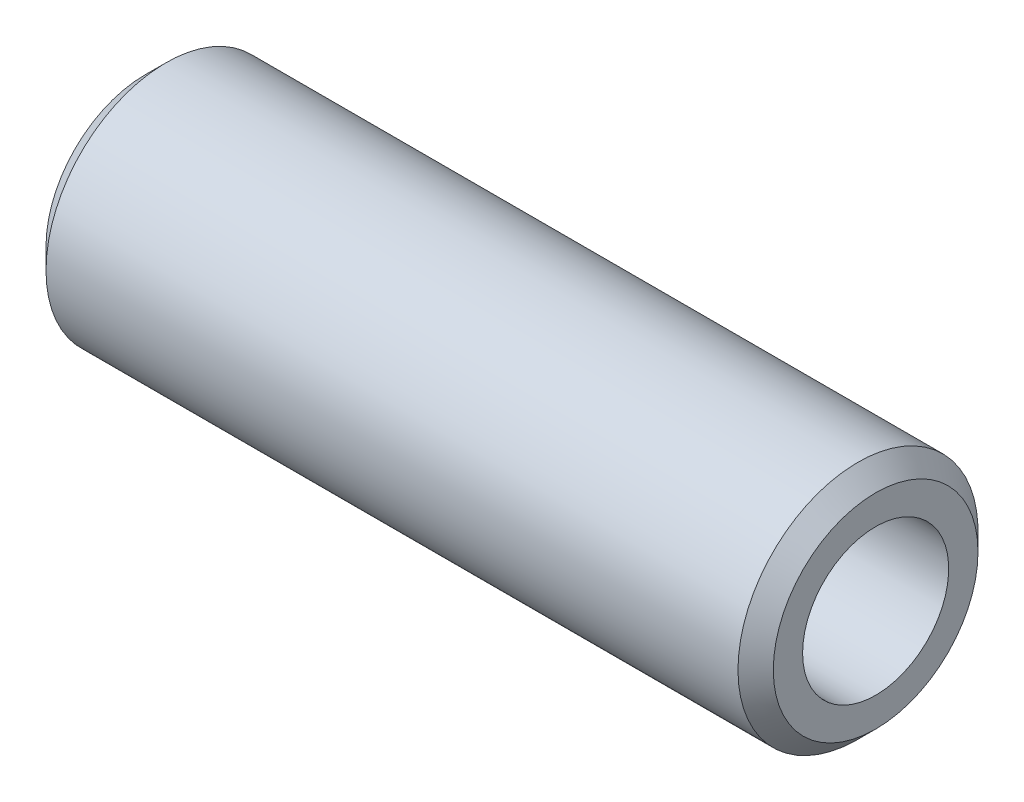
ISO-10303-21;
HEADER;
FILE_DESCRIPTION(('STEP AP214'),'2;1');
FILE_NAME('part.step','',(''),(''),'','','');
FILE_SCHEMA(('AUTOMOTIVE_DESIGN { 1 0 10303 214 1 1 1 1 }'));
ENDSEC;
DATA;
#1=APPLICATION_CONTEXT('core data for automotive mechanical design processes');
#2=APPLICATION_PROTOCOL_DEFINITION('international standard','automotive_design',2000,#1);
#3=PRODUCT_CONTEXT('',#1,'mechanical');
#4=PRODUCT('Part','Part','',(#3));
#5=PRODUCT_RELATED_PRODUCT_CATEGORY('part','',(#4));
#6=PRODUCT_DEFINITION_FORMATION('','',#4);
#7=PRODUCT_DEFINITION_CONTEXT('part definition',#1,'design');
#8=PRODUCT_DEFINITION('design','',#6,#7);
#9=PRODUCT_DEFINITION_SHAPE('','',#8);
#10=(LENGTH_UNIT() NAMED_UNIT(*) SI_UNIT(.MILLI.,.METRE.));
#11=(NAMED_UNIT(*) PLANE_ANGLE_UNIT() SI_UNIT($,.RADIAN.));
#12=(NAMED_UNIT(*) SI_UNIT($,.STERADIAN.) SOLID_ANGLE_UNIT());
#13=UNCERTAINTY_MEASURE_WITH_UNIT(LENGTH_MEASURE(1.E-05),#10,'distance_accuracy_value','');
#14=(GEOMETRIC_REPRESENTATION_CONTEXT(3) GLOBAL_UNCERTAINTY_ASSIGNED_CONTEXT((#13)) GLOBAL_UNIT_ASSIGNED_CONTEXT((#10,
#11,#12)) REPRESENTATION_CONTEXT('',''));
#15=CARTESIAN_POINT('',(0.,0.,0.));
#16=DIRECTION('',(0.,0.,1.));
#17=DIRECTION('',(1.,0.,0.));
#18=AXIS2_PLACEMENT_3D('',#15,#16,#17);
#19=CARTESIAN_POINT('',(-47.1424333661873,-1.54895755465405,0.));
#20=DIRECTION('',(-1.,0.,0.));
#21=DIRECTION('',(0.,0.,1.));
#22=AXIS2_PLACEMENT_3D('',#19,#20,#21);
#23=CYLINDRICAL_SURFACE('',#22,5.75);
#24=CARTESIAN_POINT('',(-62.7891308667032,-1.54895755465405,0.));
#25=DIRECTION('',(-1.,0.,0.));
#26=DIRECTION('',(0.,0.,1.));
#27=AXIS2_PLACEMENT_3D('',#24,#25,#26);
#28=CIRCLE('',#27,5.75);
#29=CARTESIAN_POINT('',(-62.7891308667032,-1.54895755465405,5.75));
#30=VERTEX_POINT('',#29);
#31=EDGE_CURVE('E53',#30,#30,#28,.T.);
#32=ORIENTED_EDGE('',*,*,#31,.F.);
#33=EDGE_LOOP('',(#32));
#34=FACE_BOUND('',#33,.T.);
#35=CARTESIAN_POINT('',(-29.6353843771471,-1.54895755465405,0.));
#36=DIRECTION('',(-1.,0.,0.));
#37=DIRECTION('',(0.,0.,1.));
#38=AXIS2_PLACEMENT_3D('',#35,#36,#37);
#39=CIRCLE('',#38,5.75);
#40=CARTESIAN_POINT('',(-29.6353843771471,-1.54895755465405,5.75000000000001));
#41=VERTEX_POINT('',#40);
#42=EDGE_CURVE('E10',#41,#41,#39,.T.);
#43=ORIENTED_EDGE('',*,*,#42,.T.);
#44=EDGE_LOOP('',(#43));
#45=FACE_BOUND('',#44,.T.);
#46=ADVANCED_FACE('F31',(#34,#45),#23,.T.);
#47=CARTESIAN_POINT('',(-28.7891308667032,-1.54895755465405,0.));
#48=DIRECTION('',(-1.,0.,0.));
#49=DIRECTION('',(0.,0.,1.));
#50=AXIS2_PLACEMENT_3D('',#47,#48,#49);
#51=CONICAL_SURFACE('',#50,4.90374648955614,0.78539816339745);
#52=ORIENTED_EDGE('',*,*,#42,.F.);
#53=EDGE_LOOP('',(#52));
#54=FACE_BOUND('',#53,.T.);
#55=CARTESIAN_POINT('',(-28.7891308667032,-1.54895755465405,0.));
#56=DIRECTION('',(-1.,0.,0.));
#57=DIRECTION('',(0.,0.,1.));
#58=AXIS2_PLACEMENT_3D('',#55,#56,#57);
#59=CIRCLE('',#58,4.90374648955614);
#60=CARTESIAN_POINT('',(-28.7891308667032,-1.54895755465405,4.90374648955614));
#61=VERTEX_POINT('',#60);
#62=EDGE_CURVE('E37',#61,#61,#59,.T.);
#63=ORIENTED_EDGE('',*,*,#62,.T.);
#64=EDGE_LOOP('',(#63));
#65=FACE_BOUND('',#64,.T.);
#66=ADVANCED_FACE('F60',(#54,#65),#51,.T.);
#67=CARTESIAN_POINT('',(-28.7891308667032,1.95104244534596,0.));
#68=DIRECTION('',(-1.,0.,0.));
#69=DIRECTION('',(0.,0.,1.));
#70=AXIS2_PLACEMENT_3D('',#67,#68,#69);
#71=PLANE('',#70);
#72=ORIENTED_EDGE('',*,*,#62,.F.);
#73=EDGE_LOOP('',(#72));
#74=FACE_BOUND('',#73,.T.);
#75=CARTESIAN_POINT('',(-28.7891308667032,-1.54895755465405,0.));
#76=DIRECTION('',(-1.,0.,0.));
#77=DIRECTION('',(0.,0.,1.));
#78=AXIS2_PLACEMENT_3D('',#75,#76,#77);
#79=CIRCLE('',#78,3.5);
#80=CARTESIAN_POINT('',(-28.7891308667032,-1.54895755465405,3.5));
#81=VERTEX_POINT('',#80);
#82=EDGE_CURVE('E41',#81,#81,#79,.T.);
#83=ORIENTED_EDGE('',*,*,#82,.T.);
#84=EDGE_LOOP('',(#83));
#85=FACE_BOUND('',#84,.T.);
#86=ADVANCED_FACE('F64',(#74,#85),#71,.F.);
#87=CARTESIAN_POINT('',(-47.1424333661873,-1.54895755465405,0.));
#88=DIRECTION('',(-1.,0.,0.));
#89=DIRECTION('',(0.,0.,1.));
#90=AXIS2_PLACEMENT_3D('',#87,#88,#89);
#91=CYLINDRICAL_SURFACE('',#90,3.5);
#92=ORIENTED_EDGE('',*,*,#82,.F.);
#93=EDGE_LOOP('',(#92));
#94=FACE_BOUND('',#93,.T.);
#95=CARTESIAN_POINT('',(-63.7891308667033,-1.54895755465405,0.));
#96=DIRECTION('',(-1.,0.,0.));
#97=DIRECTION('',(0.,0.,1.));
#98=AXIS2_PLACEMENT_3D('',#95,#96,#97);
#99=CIRCLE('',#98,3.5);
#100=CARTESIAN_POINT('',(-63.7891308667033,-1.54895755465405,3.5));
#101=VERTEX_POINT('',#100);
#102=EDGE_CURVE('E45',#101,#101,#99,.T.);
#103=ORIENTED_EDGE('',*,*,#102,.T.);
#104=EDGE_LOOP('',(#103));
#105=FACE_BOUND('',#104,.T.);
#106=ADVANCED_FACE('F69',(#94,#105),#91,.F.);
#107=CARTESIAN_POINT('',(-63.7891308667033,3.20104244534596,0.));
#108=DIRECTION('',(1.,0.,0.));
#109=DIRECTION('',(0.,0.,-1.));
#110=AXIS2_PLACEMENT_3D('',#107,#108,#109);
#111=PLANE('',#110);
#112=ORIENTED_EDGE('',*,*,#102,.F.);
#113=EDGE_LOOP('',(#112));
#114=FACE_BOUND('',#113,.T.);
#115=CARTESIAN_POINT('',(-63.7891308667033,-1.54895755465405,0.));
#116=DIRECTION('',(-1.,0.,0.));
#117=DIRECTION('',(0.,0.,1.));
#118=AXIS2_PLACEMENT_3D('',#115,#116,#117);
#119=CIRCLE('',#118,4.75);
#120=CARTESIAN_POINT('',(-63.7891308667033,-1.54895755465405,4.75000000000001));
#121=VERTEX_POINT('',#120);
#122=EDGE_CURVE('E50',#121,#121,#119,.T.);
#123=ORIENTED_EDGE('',*,*,#122,.T.);
#124=EDGE_LOOP('',(#123));
#125=FACE_BOUND('',#124,.T.);
#126=ADVANCED_FACE('F75',(#114,#125),#111,.F.);
#127=CARTESIAN_POINT('',(-62.7891308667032,-1.54895755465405,0.));
#128=DIRECTION('',(1.,0.,0.));
#129=DIRECTION('',(0.,0.,-1.));
#130=AXIS2_PLACEMENT_3D('',#127,#128,#129);
#131=CONICAL_SURFACE('',#130,5.75,0.785398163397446);
#132=ORIENTED_EDGE('',*,*,#122,.F.);
#133=EDGE_LOOP('',(#132));
#134=FACE_BOUND('',#133,.T.);
#135=ORIENTED_EDGE('',*,*,#31,.T.);
#136=EDGE_LOOP('',(#135));
#137=FACE_BOUND('',#136,.T.);
#138=ADVANCED_FACE('F57',(#134,#137),#131,.T.);
#139=CLOSED_SHELL('',(#46,#66,#86,#106,#126,#138));
#140=MANIFOLD_SOLID_BREP('B2',#139);
#141=ADVANCED_BREP_SHAPE_REPRESENTATION('',(#18,#140),#14);
#142=SHAPE_DEFINITION_REPRESENTATION(#9,#141);
ENDSEC;
END-ISO-10303-21;
